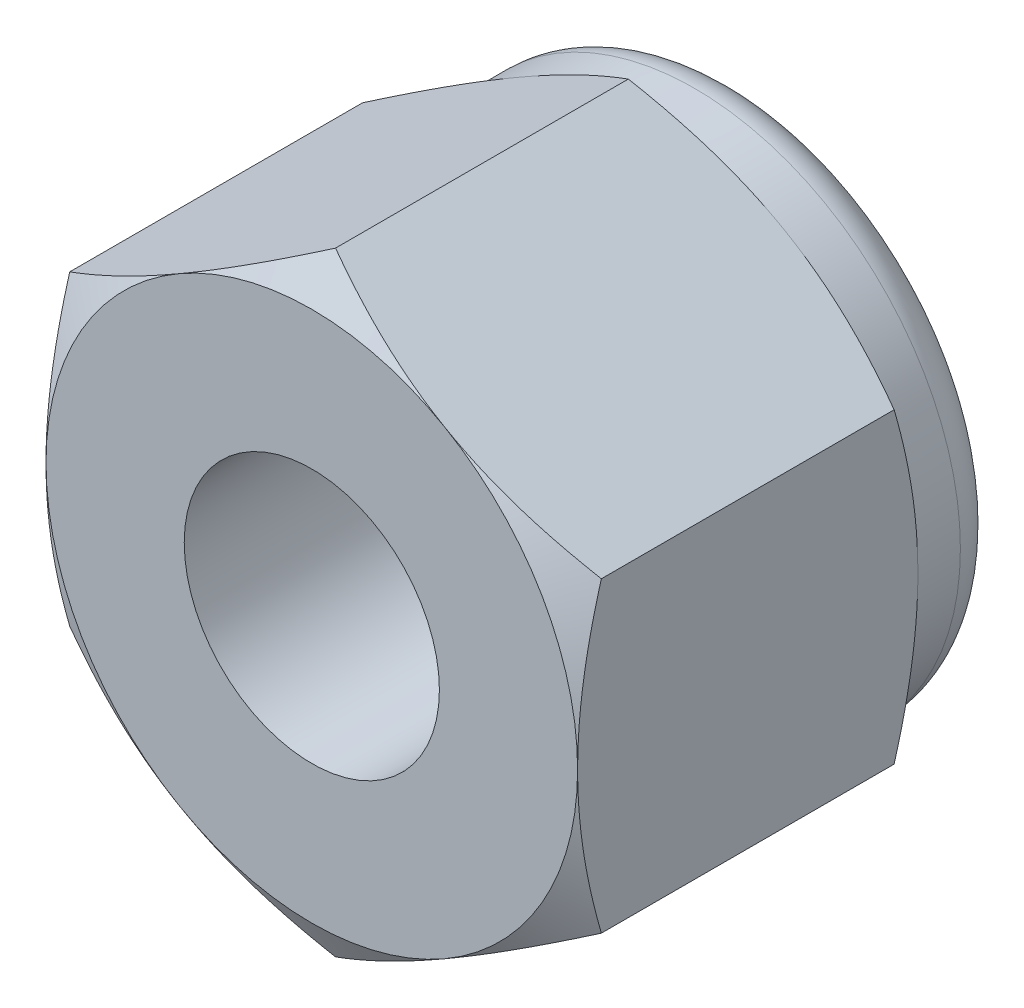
ISO-10303-21;
HEADER;
FILE_DESCRIPTION(('STEP AP214'),'2;1');
FILE_NAME('part.step','',(''),(''),'','','');
FILE_SCHEMA(('AUTOMOTIVE_DESIGN { 1 0 10303 214 1 1 1 1 }'));
ENDSEC;
DATA;
#1=APPLICATION_CONTEXT('core data for automotive mechanical design processes');
#2=APPLICATION_PROTOCOL_DEFINITION('international standard','automotive_design',2000,#1);
#3=PRODUCT_CONTEXT('',#1,'mechanical');
#4=PRODUCT('Part','Part','',(#3));
#5=PRODUCT_RELATED_PRODUCT_CATEGORY('part','',(#4));
#6=PRODUCT_DEFINITION_FORMATION('','',#4);
#7=PRODUCT_DEFINITION_CONTEXT('part definition',#1,'design');
#8=PRODUCT_DEFINITION('design','',#6,#7);
#9=PRODUCT_DEFINITION_SHAPE('','',#8);
#10=(LENGTH_UNIT() NAMED_UNIT(*) SI_UNIT(.MILLI.,.METRE.));
#11=(NAMED_UNIT(*) PLANE_ANGLE_UNIT() SI_UNIT($,.RADIAN.));
#12=(NAMED_UNIT(*) SI_UNIT($,.STERADIAN.) SOLID_ANGLE_UNIT());
#13=UNCERTAINTY_MEASURE_WITH_UNIT(LENGTH_MEASURE(1.E-05),#10,'distance_accuracy_value','');
#14=(GEOMETRIC_REPRESENTATION_CONTEXT(3) GLOBAL_UNCERTAINTY_ASSIGNED_CONTEXT((#13)) GLOBAL_UNIT_ASSIGNED_CONTEXT((#10,
#11,#12)) REPRESENTATION_CONTEXT('',''));
#15=CARTESIAN_POINT('',(0.,0.,0.));
#16=DIRECTION('',(0.,0.,1.));
#17=DIRECTION('',(1.,0.,0.));
#18=AXIS2_PLACEMENT_3D('',#15,#16,#17);
#19=CARTESIAN_POINT('',(-5.,8.66025403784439,0.));
#20=DIRECTION('',(0.,0.,-1.));
#21=DIRECTION('',(-1.,0.,0.));
#22=AXIS2_PLACEMENT_3D('',#19,#20,#21);
#23=PLANE('',#22);
#24=CARTESIAN_POINT('',(0.,0.,0.));
#25=DIRECTION('',(0.,0.,-1.));
#26=DIRECTION('',(-1.,0.,0.));
#27=AXIS2_PLACEMENT_3D('',#24,#25,#26);
#28=CIRCLE('',#27,5.);
#29=CARTESIAN_POINT('',(-5.,0.,0.));
#30=VERTEX_POINT('',#29);
#31=CARTESIAN_POINT('',(-2.5,4.3301270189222,0.));
#32=VERTEX_POINT('',#31);
#33=EDGE_CURVE('E159',#30,#32,#28,.T.);
#34=ORIENTED_EDGE('',*,*,#33,.F.);
#35=CARTESIAN_POINT('',(0.,0.,0.));
#36=DIRECTION('',(0.,0.,-1.));
#37=DIRECTION('',(-1.,0.,0.));
#38=AXIS2_PLACEMENT_3D('',#35,#36,#37);
#39=CIRCLE('',#38,5.);
#40=CARTESIAN_POINT('',(-2.5,-4.3301270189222,0.));
#41=VERTEX_POINT('',#40);
#42=EDGE_CURVE('E148',#30,#41,#39,.F.);
#43=ORIENTED_EDGE('',*,*,#42,.T.);
#44=CARTESIAN_POINT('',(2.5,-4.3301270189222,0.));
#45=VERTEX_POINT('',#44);
#46=EDGE_CURVE('E264',#41,#45,#39,.F.);
#47=ORIENTED_EDGE('',*,*,#46,.T.);
#48=CARTESIAN_POINT('',(5.,0.,0.));
#49=VERTEX_POINT('',#48);
#50=EDGE_CURVE('E269',#45,#49,#39,.F.);
#51=ORIENTED_EDGE('',*,*,#50,.T.);
#52=CARTESIAN_POINT('',(2.5,4.3301270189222,0.));
#53=VERTEX_POINT('',#52);
#54=EDGE_CURVE('E270',#49,#53,#39,.F.);
#55=ORIENTED_EDGE('',*,*,#54,.T.);
#56=EDGE_CURVE('E251',#53,#32,#39,.F.);
#57=ORIENTED_EDGE('',*,*,#56,.T.);
#58=EDGE_LOOP('',(#34,#43,#47,#51,#55,#57));
#59=FACE_BOUND('',#58,.T.);
#60=CARTESIAN_POINT('',(0.,0.,0.));
#61=DIRECTION('',(0.,0.,1.));
#62=DIRECTION('',(1.,0.,0.));
#63=AXIS2_PLACEMENT_3D('',#60,#61,#62);
#64=CIRCLE('',#63,2.4);
#65=CARTESIAN_POINT('',(2.4,0.,0.));
#66=VERTEX_POINT('',#65);
#67=EDGE_CURVE('E548',#66,#66,#64,.T.);
#68=ORIENTED_EDGE('',*,*,#67,.F.);
#69=EDGE_LOOP('',(#68));
#70=FACE_BOUND('',#69,.T.);
#71=ADVANCED_FACE('F35',(#59,#70),#23,.F.);
#72=CARTESIAN_POINT('',(0.,0.,0.));
#73=DIRECTION('',(0.,0.,-1.));
#74=DIRECTION('',(-1.,0.,0.));
#75=AXIS2_PLACEMENT_3D('',#72,#73,#74);
#76=CONICAL_SURFACE('',#75,5.,1.0471975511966);
#77=CARTESIAN_POINT('',(-5.,-7.81723155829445,-2.47077013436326));
#78=CARTESIAN_POINT('',(-5.,-7.59828218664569,-2.36430801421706));
#79=CARTESIAN_POINT('',(-5.,-7.37883686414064,-2.2588487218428));
#80=CARTESIAN_POINT('',(-5.,-6.93869075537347,-2.05049866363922));
#81=CARTESIAN_POINT('',(-5.,-6.71798978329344,-1.94760829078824));
#82=CARTESIAN_POINT('',(-5.,-6.27396202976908,-1.74445489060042));
#83=CARTESIAN_POINT('',(-5.,-6.05062753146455,-1.64420867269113));
#84=CARTESIAN_POINT('',(-5.,-5.60220380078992,-1.44773613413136));
#85=CARTESIAN_POINT('',(-5.,-5.37711465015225,-1.35150962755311));
#86=CARTESIAN_POINT('',(-5.,-4.91738090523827,-1.16105250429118));
#87=CARTESIAN_POINT('',(-5.,-4.68266557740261,-1.06699171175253));
#88=CARTESIAN_POINT('',(-5.,-4.21051243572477,-0.885837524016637));
#89=CARTESIAN_POINT('',(-5.,-3.97307432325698,-0.798744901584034));
#90=CARTESIAN_POINT('',(-5.,-3.49552198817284,-0.633766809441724));
#91=CARTESIAN_POINT('',(-5.,-3.25541407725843,-0.555863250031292));
#92=CARTESIAN_POINT('',(-5.,-2.77175465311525,-0.411721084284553));
#93=CARTESIAN_POINT('',(-5.,-2.52820422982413,-0.345478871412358));
#94=CARTESIAN_POINT('',(-5.,-2.0388544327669,-0.228144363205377));
#95=CARTESIAN_POINT('',(-5.,-1.7930752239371,-0.176969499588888));
#96=CARTESIAN_POINT('',(-5.,-1.29839566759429,-0.0926283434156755));
#97=CARTESIAN_POINT('',(-5.,-1.04949564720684,-0.0594601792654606));
#98=CARTESIAN_POINT('',(-5.,-0.553095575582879,-0.01420982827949));
#99=CARTESIAN_POINT('',(-5.,-0.305621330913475,-0.00185152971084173));
#100=CARTESIAN_POINT('',(-5.,0.189494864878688,0.00146225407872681));
#101=CARTESIAN_POINT('',(-5.,0.437136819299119,-0.00758269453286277));
#102=CARTESIAN_POINT('',(-5.,0.855652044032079,-0.0403090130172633));
#103=CARTESIAN_POINT('',(-5.,1.02696545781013,-0.0587018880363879));
#104=CARTESIAN_POINT('',(-5.,1.36837224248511,-0.104619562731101));
#105=CARTESIAN_POINT('',(-5.,1.53846545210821,-0.132145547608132));
#106=CARTESIAN_POINT('',(-5.,2.04666453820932,-0.226979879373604));
#107=CARTESIAN_POINT('',(-5.,2.38251350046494,-0.306528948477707));
#108=CARTESIAN_POINT('',(-5.,2.88489620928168,-0.444928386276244));
#109=CARTESIAN_POINT('',(-5.,3.05402007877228,-0.494915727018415));
#110=CARTESIAN_POINT('',(-5.,3.39062537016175,-0.600192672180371));
#111=CARTESIAN_POINT('',(-5.,3.55810677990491,-0.655482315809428));
#112=CARTESIAN_POINT('',(-5.,3.89147981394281,-0.770467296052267));
#113=CARTESIAN_POINT('',(-5.,4.05737190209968,-0.83016130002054));
#114=CARTESIAN_POINT('',(-5.,4.38777251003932,-0.953241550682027));
#115=CARTESIAN_POINT('',(-5.,4.55228105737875,-1.01662772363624));
#116=CARTESIAN_POINT('',(-5.,4.98255550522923,-1.18707624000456));
#117=CARTESIAN_POINT('',(-5.,5.24731881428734,-1.2966666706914));
#118=CARTESIAN_POINT('',(-5.,5.7742359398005,-1.52197179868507));
#119=CARTESIAN_POINT('',(-5.,6.03638950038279,-1.63768708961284));
#120=CARTESIAN_POINT('',(-5.,6.55866181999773,-1.87383970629));
#121=CARTESIAN_POINT('',(-5.,6.81877985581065,-1.99427862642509));
#122=CARTESIAN_POINT('',(-5.,7.33728725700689,-2.23878712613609));
#123=CARTESIAN_POINT('',(-5.,7.59567668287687,-2.36285657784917));
#124=CARTESIAN_POINT('',(-5.,8.11143726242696,-2.61404271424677));
#125=CARTESIAN_POINT('',(-5.,8.36880636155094,-2.74116360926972));
#126=CARTESIAN_POINT('',(-5.,8.88239741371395,-2.99770431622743));
#127=CARTESIAN_POINT('',(-5.,9.13861935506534,-3.12712415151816));
#128=CARTESIAN_POINT('',(-5.,9.90577282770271,-3.5180968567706));
#129=CARTESIAN_POINT('',(-5.,10.4152951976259,-3.78241365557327));
#130=CARTESIAN_POINT('',(-5.,11.3805473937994,-4.28915771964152));
#131=CARTESIAN_POINT('',(-5.,11.836528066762,-4.53110943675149));
#132=CARTESIAN_POINT('',(-5.,12.7469286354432,-5.01798929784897));
#133=CARTESIAN_POINT('',(-5.,13.2013484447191,-5.26291760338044));
#134=CARTESIAN_POINT('',(-5.,14.1075674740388,-5.75422083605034));
#135=CARTESIAN_POINT('',(-5.,14.5593704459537,-6.00058885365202));
#136=CARTESIAN_POINT('',(-5.,15.4619992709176,-6.49503212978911));
#137=CARTESIAN_POINT('',(-5.,15.9128251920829,-6.7431072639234));
#138=CARTESIAN_POINT('',(-5.,16.3633042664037,-6.99180668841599));
#139=B_SPLINE_CURVE_WITH_KNOTS('',3,(#77,#78,#79,#80,#81,#82,#83,#84,#85,#86,#87,#88,#89,#90,
#91,#92,#93,#94,#95,#96,#97,#98,#99,#100,#101,#102,#103,#104,#105,#106,#107,#108,#109,#110,#111,
#112,#113,#114,#115,#116,#117,#118,#119,#120,#121,#122,#123,#124,#125,#126,#127,#128,#129,#130,
#131,#132,#133,#134,#135,#136,#137,#138),.UNSPECIFIED.,.F.,.F.,(4,2,2,2,2,2,2,2,2,2,2,2,2,2,2,2,
2,2,2,2,2,2,2,2,2,2,2,2,2,2,4),(0.,0.730390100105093,1.46089125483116,2.19526294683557,
2.92960063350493,3.68809828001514,4.44667992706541,5.20374237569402,5.96057027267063,
6.71317011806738,7.46569172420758,8.20814759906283,8.95061852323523,9.46726307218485,
9.98397469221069,11.0179267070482,11.5469496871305,12.0759765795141,12.6048440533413,
13.1337009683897,13.993231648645,14.8528457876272,15.712752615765,16.5726291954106,
17.4337694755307,18.2949185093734,20.016871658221,21.5654503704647,23.1141135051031,
24.6579386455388,26.2016524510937),.UNSPECIFIED.);
#140=CARTESIAN_POINT('',(-5.,2.88675134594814,-0.446581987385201));
#141=VERTEX_POINT('',#140);
#142=EDGE_CURVE('E176',#141,#30,#139,.F.);
#143=ORIENTED_EDGE('',*,*,#142,.T.);
#144=ORIENTED_EDGE('',*,*,#33,.T.);
#145=CARTESIAN_POINT('',(0.0002,5.7736181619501,-0.446648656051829));
#146=CARTESIAN_POINT('',(-0.219534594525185,5.64675433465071,-0.373386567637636));
#147=CARTESIAN_POINT('',(-0.441148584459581,5.5188054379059,-0.306751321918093));
#148=CARTESIAN_POINT('',(-0.888213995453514,5.26069210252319,-0.190438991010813));
#149=CARTESIAN_POINT('',(-1.11367335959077,5.13052307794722,-0.140803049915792));
#150=CARTESIAN_POINT('',(-1.56183230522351,4.87177839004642,-0.0635510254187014));
#151=CARTESIAN_POINT('',(-1.78446209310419,4.74324302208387,-0.0354203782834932));
#152=CARTESIAN_POINT('',(-2.11918990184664,4.54998783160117,-0.0101949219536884));
#153=CARTESIAN_POINT('',(-2.23084219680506,4.48552534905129,-0.00461345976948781));
#154=CARTESIAN_POINT('',(-2.4542499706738,4.35654081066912,0.000797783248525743));
#155=CARTESIAN_POINT('',(-2.56600544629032,4.29201875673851,0.000627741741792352));
#156=CARTESIAN_POINT('',(-2.87218423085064,4.11524635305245,-0.00775363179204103));
#157=CARTESIAN_POINT('',(-3.06650608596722,4.00305457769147,-0.0218297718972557));
#158=CARTESIAN_POINT('',(-3.45386010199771,3.77941563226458,-0.0664652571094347));
#159=CARTESIAN_POINT('',(-3.64689090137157,3.66796924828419,-0.0970398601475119));
#160=CARTESIAN_POINT('',(-4.03502534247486,3.44387972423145,-0.173468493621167));
#161=CARTESIAN_POINT('',(-4.23007999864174,3.33126486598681,-0.219646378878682));
#162=CARTESIAN_POINT('',(-4.61728034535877,3.10771464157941,-0.324451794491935));
#163=CARTESIAN_POINT('',(-4.80943099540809,2.99677641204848,-0.383054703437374));
#164=CARTESIAN_POINT('',(-5.0002,2.8866358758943,-0.446648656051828));
#165=B_SPLINE_CURVE_WITH_KNOTS('',3,(#145,#146,#147,#148,#149,#150,#151,#152,#153,#154,#155,
#156,#157,#158,#159,#160,#161,#162,#163,#164),.UNSPECIFIED.,.F.,.F.,(4,2,2,2,2,2,2,2,2,4),(0.,
0.792555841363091,1.58701660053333,2.36181537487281,2.74884076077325,3.13585419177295,
3.80962362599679,4.48401723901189,5.17336882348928,5.86136694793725),.UNSPECIFIED.);
#166=EDGE_CURVE('E163',#32,#141,#165,.T.);
#167=ORIENTED_EDGE('',*,*,#166,.T.);
#168=EDGE_LOOP('',(#143,#144,#167));
#169=FACE_BOUND('',#168,.T.);
#170=ADVANCED_FACE('F183',(#169),#76,.T.);
#171=CARTESIAN_POINT('',(5.0002,2.8866358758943,-0.446648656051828));
#172=CARTESIAN_POINT('',(4.78046540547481,3.01349970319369,-0.373386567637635));
#173=CARTESIAN_POINT('',(4.55885141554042,3.1414485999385,-0.306751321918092));
#174=CARTESIAN_POINT('',(4.11178600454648,3.39956193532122,-0.190438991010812));
#175=CARTESIAN_POINT('',(3.88632664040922,3.52973095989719,-0.140803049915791));
#176=CARTESIAN_POINT('',(3.43816769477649,3.78847564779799,-0.063551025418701));
#177=CARTESIAN_POINT('',(3.2155379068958,3.91701101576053,-0.035420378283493));
#178=CARTESIAN_POINT('',(2.88081009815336,4.11026620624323,-0.0101949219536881));
#179=CARTESIAN_POINT('',(2.76915780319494,4.17472868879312,-0.00461345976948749));
#180=CARTESIAN_POINT('',(2.5457500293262,4.30371322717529,0.000797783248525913));
#181=CARTESIAN_POINT('',(2.43399455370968,4.3682352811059,0.00062774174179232));
#182=CARTESIAN_POINT('',(2.12781576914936,4.54500768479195,-0.00775363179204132));
#183=CARTESIAN_POINT('',(1.93349391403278,4.65719946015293,-0.0218297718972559));
#184=CARTESIAN_POINT('',(1.54613989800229,4.88083840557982,-0.0664652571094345));
#185=CARTESIAN_POINT('',(1.35310909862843,4.99228478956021,-0.0970398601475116));
#186=CARTESIAN_POINT('',(0.964974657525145,5.21637431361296,-0.173468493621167));
#187=CARTESIAN_POINT('',(0.769920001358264,5.32898917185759,-0.219646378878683));
#188=CARTESIAN_POINT('',(0.382719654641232,5.55253939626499,-0.324451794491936));
#189=CARTESIAN_POINT('',(0.190569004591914,5.66347762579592,-0.383054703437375));
#190=CARTESIAN_POINT('',(-0.000199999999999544,5.7736181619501,-0.446648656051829));
#191=B_SPLINE_CURVE_WITH_KNOTS('',3,(#171,#172,#173,#174,#175,#176,#177,#178,#179,#180,#181,
#182,#183,#184,#185,#186,#187,#188,#189,#190),.UNSPECIFIED.,.F.,.F.,(4,2,2,2,2,2,2,2,2,4),(0.,
0.792555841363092,1.58701660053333,2.36181537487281,2.74884076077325,3.13585419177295,
3.80962362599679,4.48401723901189,5.17336882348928,5.86136694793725),.UNSPECIFIED.);
#192=CARTESIAN_POINT('',(0.,5.77350269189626,-0.446581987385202));
#193=VERTEX_POINT('',#192);
#194=EDGE_CURVE('E201',#53,#193,#191,.T.);
#195=ORIENTED_EDGE('',*,*,#194,.T.);
#196=EDGE_CURVE('E175',#193,#32,#165,.T.);
#197=ORIENTED_EDGE('',*,*,#196,.T.);
#198=ORIENTED_EDGE('',*,*,#56,.F.);
#199=EDGE_LOOP('',(#195,#197,#198));
#200=FACE_BOUND('',#199,.T.);
#201=ADVANCED_FACE('F188',(#200),#76,.T.);
#202=CARTESIAN_POINT('',(5.,-7.81723155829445,-2.47077013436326));
#203=CARTESIAN_POINT('',(5.,-7.59828218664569,-2.36430801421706));
#204=CARTESIAN_POINT('',(5.,-7.37883686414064,-2.2588487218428));
#205=CARTESIAN_POINT('',(5.,-6.93869075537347,-2.05049866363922));
#206=CARTESIAN_POINT('',(5.,-6.71798978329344,-1.94760829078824));
#207=CARTESIAN_POINT('',(5.,-6.27396202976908,-1.74445489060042));
#208=CARTESIAN_POINT('',(5.,-6.05062753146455,-1.64420867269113));
#209=CARTESIAN_POINT('',(5.,-5.60220380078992,-1.44773613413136));
#210=CARTESIAN_POINT('',(5.,-5.37711465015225,-1.35150962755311));
#211=CARTESIAN_POINT('',(5.,-4.91738090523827,-1.16105250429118));
#212=CARTESIAN_POINT('',(5.,-4.68266557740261,-1.06699171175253));
#213=CARTESIAN_POINT('',(5.,-4.21051243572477,-0.885837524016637));
#214=CARTESIAN_POINT('',(5.,-3.97307432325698,-0.798744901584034));
#215=CARTESIAN_POINT('',(5.,-3.49552198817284,-0.633766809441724));
#216=CARTESIAN_POINT('',(5.,-3.25541407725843,-0.555863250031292));
#217=CARTESIAN_POINT('',(5.,-2.77175465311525,-0.411721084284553));
#218=CARTESIAN_POINT('',(5.,-2.52820422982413,-0.345478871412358));
#219=CARTESIAN_POINT('',(5.,-2.0388544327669,-0.228144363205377));
#220=CARTESIAN_POINT('',(5.,-1.7930752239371,-0.176969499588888));
#221=CARTESIAN_POINT('',(5.,-1.29839566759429,-0.0926283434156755));
#222=CARTESIAN_POINT('',(5.,-1.04949564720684,-0.0594601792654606));
#223=CARTESIAN_POINT('',(5.,-0.553095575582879,-0.01420982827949));
#224=CARTESIAN_POINT('',(5.,-0.305621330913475,-0.00185152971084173));
#225=CARTESIAN_POINT('',(5.,0.189494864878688,0.00146225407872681));
#226=CARTESIAN_POINT('',(5.,0.437136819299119,-0.00758269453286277));
#227=CARTESIAN_POINT('',(5.,0.855652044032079,-0.0403090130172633));
#228=CARTESIAN_POINT('',(5.,1.02696545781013,-0.0587018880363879));
#229=CARTESIAN_POINT('',(5.,1.36837224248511,-0.104619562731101));
#230=CARTESIAN_POINT('',(5.,1.53846545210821,-0.132145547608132));
#231=CARTESIAN_POINT('',(5.,2.04666453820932,-0.226979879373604));
#232=CARTESIAN_POINT('',(5.,2.38251350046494,-0.306528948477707));
#233=CARTESIAN_POINT('',(5.,2.88489620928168,-0.444928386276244));
#234=CARTESIAN_POINT('',(5.,3.05402007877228,-0.494915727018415));
#235=CARTESIAN_POINT('',(5.,3.39062537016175,-0.600192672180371));
#236=CARTESIAN_POINT('',(5.,3.55810677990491,-0.655482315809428));
#237=CARTESIAN_POINT('',(5.,3.89147981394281,-0.770467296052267));
#238=CARTESIAN_POINT('',(5.,4.05737190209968,-0.83016130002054));
#239=CARTESIAN_POINT('',(5.,4.38777251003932,-0.953241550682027));
#240=CARTESIAN_POINT('',(5.,4.55228105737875,-1.01662772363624));
#241=CARTESIAN_POINT('',(5.,4.98255550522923,-1.18707624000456));
#242=CARTESIAN_POINT('',(5.,5.24731881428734,-1.2966666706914));
#243=CARTESIAN_POINT('',(5.,5.7742359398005,-1.52197179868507));
#244=CARTESIAN_POINT('',(5.,6.03638950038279,-1.63768708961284));
#245=CARTESIAN_POINT('',(5.,6.55866181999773,-1.87383970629));
#246=CARTESIAN_POINT('',(5.,6.81877985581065,-1.99427862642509));
#247=CARTESIAN_POINT('',(5.,7.33728725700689,-2.23878712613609));
#248=CARTESIAN_POINT('',(5.,7.59567668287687,-2.36285657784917));
#249=CARTESIAN_POINT('',(5.,8.11143726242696,-2.61404271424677));
#250=CARTESIAN_POINT('',(5.,8.36880636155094,-2.74116360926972));
#251=CARTESIAN_POINT('',(5.,8.88239741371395,-2.99770431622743));
#252=CARTESIAN_POINT('',(5.,9.13861935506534,-3.12712415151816));
#253=CARTESIAN_POINT('',(5.,9.90577282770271,-3.5180968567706));
#254=CARTESIAN_POINT('',(5.,10.4152951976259,-3.78241365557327));
#255=CARTESIAN_POINT('',(5.,11.3805473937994,-4.28915771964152));
#256=CARTESIAN_POINT('',(5.,11.836528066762,-4.53110943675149));
#257=CARTESIAN_POINT('',(5.,12.7469286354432,-5.01798929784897));
#258=CARTESIAN_POINT('',(5.,13.2013484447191,-5.26291760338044));
#259=CARTESIAN_POINT('',(5.,14.1075674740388,-5.75422083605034));
#260=CARTESIAN_POINT('',(5.,14.5593704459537,-6.00058885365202));
#261=CARTESIAN_POINT('',(5.,15.4619992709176,-6.49503212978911));
#262=CARTESIAN_POINT('',(5.,15.9128251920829,-6.7431072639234));
#263=CARTESIAN_POINT('',(5.,16.3633042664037,-6.99180668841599));
#264=B_SPLINE_CURVE_WITH_KNOTS('',3,(#202,#203,#204,#205,#206,#207,#208,#209,#210,#211,#212,
#213,#214,#215,#216,#217,#218,#219,#220,#221,#222,#223,#224,#225,#226,#227,#228,#229,#230,#231,
#232,#233,#234,#235,#236,#237,#238,#239,#240,#241,#242,#243,#244,#245,#246,#247,#248,#249,#250,
#251,#252,#253,#254,#255,#256,#257,#258,#259,#260,#261,#262,#263),.UNSPECIFIED.,.F.,.F.,(4,2,2,
2,2,2,2,2,2,2,2,2,2,2,2,2,2,2,2,2,2,2,2,2,2,2,2,2,2,2,4),(0.,0.730390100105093,1.46089125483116,
2.19526294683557,2.92960063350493,3.68809828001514,4.44667992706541,5.20374237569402,
5.96057027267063,6.71317011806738,7.46569172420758,8.20814759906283,8.95061852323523,
9.46726307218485,9.98397469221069,11.0179267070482,11.5469496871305,12.0759765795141,
12.6048440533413,13.1337009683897,13.993231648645,14.8528457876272,15.712752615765,
16.5726291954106,17.4337694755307,18.2949185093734,20.016871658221,21.5654503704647,
23.1141135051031,24.6579386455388,26.2016524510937),.UNSPECIFIED.);
#265=CARTESIAN_POINT('',(5.,2.88675134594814,-0.446581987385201));
#266=VERTEX_POINT('',#265);
#267=EDGE_CURVE('E212',#49,#266,#264,.T.);
#268=ORIENTED_EDGE('',*,*,#267,.T.);
#269=EDGE_CURVE('E289',#266,#53,#191,.T.);
#270=ORIENTED_EDGE('',*,*,#269,.T.);
#271=ORIENTED_EDGE('',*,*,#54,.F.);
#272=EDGE_LOOP('',(#268,#270,#271));
#273=FACE_BOUND('',#272,.T.);
#274=ADVANCED_FACE('F288',(#273),#76,.T.);
#275=CARTESIAN_POINT('',(-0.0002,-5.7736181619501,-0.446648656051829));
#276=CARTESIAN_POINT('',(0.219534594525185,-5.64675433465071,-0.373386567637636));
#277=CARTESIAN_POINT('',(0.441148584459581,-5.5188054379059,-0.306751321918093));
#278=CARTESIAN_POINT('',(0.888213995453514,-5.26069210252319,-0.190438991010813));
#279=CARTESIAN_POINT('',(1.11367335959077,-5.13052307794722,-0.140803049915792));
#280=CARTESIAN_POINT('',(1.56183230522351,-4.87177839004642,-0.0635510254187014));
#281=CARTESIAN_POINT('',(1.78446209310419,-4.74324302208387,-0.0354203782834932));
#282=CARTESIAN_POINT('',(2.11918990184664,-4.54998783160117,-0.0101949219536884));
#283=CARTESIAN_POINT('',(2.23084219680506,-4.48552534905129,-0.00461345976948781));
#284=CARTESIAN_POINT('',(2.4542499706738,-4.35654081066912,0.000797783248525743));
#285=CARTESIAN_POINT('',(2.56600544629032,-4.29201875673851,0.000627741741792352));
#286=CARTESIAN_POINT('',(2.87218423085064,-4.11524635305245,-0.00775363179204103));
#287=CARTESIAN_POINT('',(3.06650608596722,-4.00305457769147,-0.0218297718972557));
#288=CARTESIAN_POINT('',(3.45386010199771,-3.77941563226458,-0.0664652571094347));
#289=CARTESIAN_POINT('',(3.64689090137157,-3.66796924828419,-0.0970398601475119));
#290=CARTESIAN_POINT('',(4.03502534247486,-3.44387972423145,-0.173468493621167));
#291=CARTESIAN_POINT('',(4.23007999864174,-3.33126486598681,-0.219646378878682));
#292=CARTESIAN_POINT('',(4.61728034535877,-3.10771464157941,-0.324451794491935));
#293=CARTESIAN_POINT('',(4.80943099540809,-2.99677641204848,-0.383054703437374));
#294=CARTESIAN_POINT('',(5.0002,-2.8866358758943,-0.446648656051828));
#295=B_SPLINE_CURVE_WITH_KNOTS('',3,(#275,#276,#277,#278,#279,#280,#281,#282,#283,#284,#285,
#286,#287,#288,#289,#290,#291,#292,#293,#294),.UNSPECIFIED.,.F.,.F.,(4,2,2,2,2,2,2,2,2,4),(0.,
0.792555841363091,1.58701660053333,2.36181537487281,2.74884076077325,3.13585419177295,
3.80962362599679,4.48401723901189,5.17336882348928,5.86136694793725),.UNSPECIFIED.);
#296=CARTESIAN_POINT('',(5.,-2.88675134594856,-0.446581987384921));
#297=VERTEX_POINT('',#296);
#298=EDGE_CURVE('E218',#45,#297,#295,.T.);
#299=ORIENTED_EDGE('',*,*,#298,.T.);
#300=EDGE_CURVE('E217',#297,#49,#264,.T.);
#301=ORIENTED_EDGE('',*,*,#300,.T.);
#302=ORIENTED_EDGE('',*,*,#50,.F.);
#303=EDGE_LOOP('',(#299,#301,#302));
#304=FACE_BOUND('',#303,.T.);
#305=ADVANCED_FACE('F312',(#304),#76,.T.);
#306=CARTESIAN_POINT('',(0.,-5.77350269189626,-0.446581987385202));
#307=VERTEX_POINT('',#306);
#308=EDGE_CURVE('E138',#307,#45,#295,.T.);
#309=ORIENTED_EDGE('',*,*,#308,.T.);
#310=ORIENTED_EDGE('',*,*,#46,.F.);
#311=CARTESIAN_POINT('',(-5.0002,-2.8866358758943,-0.446648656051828));
#312=CARTESIAN_POINT('',(-4.78046540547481,-3.01349970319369,-0.373386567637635));
#313=CARTESIAN_POINT('',(-4.55885141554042,-3.1414485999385,-0.306751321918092));
#314=CARTESIAN_POINT('',(-4.11178600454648,-3.39956193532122,-0.190438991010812));
#315=CARTESIAN_POINT('',(-3.88632664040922,-3.52973095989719,-0.140803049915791));
#316=CARTESIAN_POINT('',(-3.43816769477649,-3.78847564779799,-0.063551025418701));
#317=CARTESIAN_POINT('',(-3.2155379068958,-3.91701101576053,-0.035420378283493));
#318=CARTESIAN_POINT('',(-2.88081009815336,-4.11026620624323,-0.0101949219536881));
#319=CARTESIAN_POINT('',(-2.76915780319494,-4.17472868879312,-0.00461345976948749));
#320=CARTESIAN_POINT('',(-2.5457500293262,-4.30371322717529,0.000797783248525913));
#321=CARTESIAN_POINT('',(-2.43399455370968,-4.3682352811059,0.00062774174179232));
#322=CARTESIAN_POINT('',(-2.12781576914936,-4.54500768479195,-0.00775363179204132));
#323=CARTESIAN_POINT('',(-1.93349391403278,-4.65719946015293,-0.0218297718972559));
#324=CARTESIAN_POINT('',(-1.54613989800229,-4.88083840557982,-0.0664652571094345));
#325=CARTESIAN_POINT('',(-1.35310909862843,-4.99228478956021,-0.0970398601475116));
#326=CARTESIAN_POINT('',(-0.964974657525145,-5.21637431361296,-0.173468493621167));
#327=CARTESIAN_POINT('',(-0.769920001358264,-5.32898917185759,-0.219646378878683));
#328=CARTESIAN_POINT('',(-0.382719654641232,-5.55253939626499,-0.324451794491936));
#329=CARTESIAN_POINT('',(-0.190569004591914,-5.66347762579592,-0.383054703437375));
#330=CARTESIAN_POINT('',(0.000199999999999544,-5.7736181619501,-0.446648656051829));
#331=B_SPLINE_CURVE_WITH_KNOTS('',3,(#311,#312,#313,#314,#315,#316,#317,#318,#319,#320,#321,
#322,#323,#324,#325,#326,#327,#328,#329,#330),.UNSPECIFIED.,.F.,.F.,(4,2,2,2,2,2,2,2,2,4),(0.,
0.792555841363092,1.58701660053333,2.36181537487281,2.74884076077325,3.13585419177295,
3.80962362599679,4.48401723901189,5.17336882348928,5.86136694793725),.UNSPECIFIED.);
#332=EDGE_CURVE('E309',#41,#307,#331,.T.);
#333=ORIENTED_EDGE('',*,*,#332,.T.);
#334=EDGE_LOOP('',(#309,#310,#333));
#335=FACE_BOUND('',#334,.T.);
#336=ADVANCED_FACE('F190',(#335),#76,.T.);
#337=CARTESIAN_POINT('',(-5.,-2.88675134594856,-0.446581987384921));
#338=VERTEX_POINT('',#337);
#339=EDGE_CURVE('E206',#338,#41,#331,.T.);
#340=ORIENTED_EDGE('',*,*,#339,.T.);
#341=ORIENTED_EDGE('',*,*,#42,.F.);
#342=EDGE_CURVE('E292',#30,#338,#139,.F.);
#343=ORIENTED_EDGE('',*,*,#342,.T.);
#344=EDGE_LOOP('',(#340,#341,#343));
#345=FACE_BOUND('',#344,.T.);
#346=ADVANCED_FACE('F305',(#345),#76,.T.);
#347=CARTESIAN_POINT('',(5.,2.88675134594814,-6.4));
#348=DIRECTION('',(0.5,0.866025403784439,0.));
#349=DIRECTION('',(-0.866025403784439,0.5,0.));
#350=AXIS2_PLACEMENT_3D('',#347,#348,#349);
#351=PLANE('',#350);
#352=CARTESIAN_POINT('',(-0.0002,5.7736181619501,-5.95335134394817));
#353=CARTESIAN_POINT('',(0.219534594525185,5.64675433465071,-6.02661343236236));
#354=CARTESIAN_POINT('',(0.441148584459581,5.5188054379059,-6.09324867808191));
#355=CARTESIAN_POINT('',(0.888213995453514,5.26069210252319,-6.20956100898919));
#356=CARTESIAN_POINT('',(1.11367335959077,5.13052307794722,-6.25919695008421));
#357=CARTESIAN_POINT('',(1.56183230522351,4.87177839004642,-6.3364489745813));
#358=CARTESIAN_POINT('',(1.78446209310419,4.74324302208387,-6.3645796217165));
#359=CARTESIAN_POINT('',(2.11918990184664,4.54998783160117,-6.38980507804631));
#360=CARTESIAN_POINT('',(2.23084219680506,4.48552534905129,-6.39538654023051));
#361=CARTESIAN_POINT('',(2.4542499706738,4.35654081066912,-6.40079778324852));
#362=CARTESIAN_POINT('',(2.56600544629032,4.29201875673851,-6.40062774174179));
#363=CARTESIAN_POINT('',(2.87218423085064,4.11524635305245,-6.39224636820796));
#364=CARTESIAN_POINT('',(3.06650608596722,4.00305457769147,-6.37817022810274));
#365=CARTESIAN_POINT('',(3.45386010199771,3.77941563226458,-6.33353474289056));
#366=CARTESIAN_POINT('',(3.64689090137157,3.66796924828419,-6.30296013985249));
#367=CARTESIAN_POINT('',(4.03502534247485,3.44387972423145,-6.22653150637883));
#368=CARTESIAN_POINT('',(4.23007999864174,3.33126486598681,-6.18035362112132));
#369=CARTESIAN_POINT('',(4.61728034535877,3.10771464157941,-6.07554820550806));
#370=CARTESIAN_POINT('',(4.80943099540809,2.99677641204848,-6.01694529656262));
#371=CARTESIAN_POINT('',(5.0002,2.8866358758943,-5.95335134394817));
#372=B_SPLINE_CURVE_WITH_KNOTS('',3,(#352,#353,#354,#355,#356,#357,#358,#359,#360,#361,#362,
#363,#364,#365,#366,#367,#368,#369,#370,#371),.UNSPECIFIED.,.F.,.F.,(4,2,2,2,2,2,2,2,2,4),(0.,
0.792555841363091,1.58701660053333,2.36181537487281,2.74884076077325,3.13585419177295,
3.80962362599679,4.48401723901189,5.17336882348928,5.86136694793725),.UNSPECIFIED.);
#373=CARTESIAN_POINT('',(0.,5.77350269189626,-5.9534180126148));
#374=VERTEX_POINT('',#373);
#375=CARTESIAN_POINT('',(2.5,4.3301270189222,-6.4));
#376=VERTEX_POINT('',#375);
#377=EDGE_CURVE('E142',#374,#376,#372,.T.);
#378=ORIENTED_EDGE('',*,*,#377,.F.);
#379=DIRECTION('',(0.,0.,1.));
#380=VECTOR('',#379,1.);
#381=CARTESIAN_POINT('',(0.,5.77350269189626,-6.4));
#382=LINE('',#381,#380);
#383=EDGE_CURVE('E135',#374,#193,#382,.T.);
#384=ORIENTED_EDGE('',*,*,#383,.T.);
#385=ORIENTED_EDGE('',*,*,#194,.F.);
#386=ORIENTED_EDGE('',*,*,#269,.F.);
#387=DIRECTION('',(0.,0.,1.));
#388=VECTOR('',#387,1.);
#389=CARTESIAN_POINT('',(5.,2.88675134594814,-6.4));
#390=LINE('',#389,#388);
#391=CARTESIAN_POINT('',(5.,2.88675134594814,-5.9534180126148));
#392=VERTEX_POINT('',#391);
#393=EDGE_CURVE('E248',#392,#266,#390,.T.);
#394=ORIENTED_EDGE('',*,*,#393,.F.);
#395=EDGE_CURVE('E243',#376,#392,#372,.T.);
#396=ORIENTED_EDGE('',*,*,#395,.F.);
#397=EDGE_LOOP('',(#378,#384,#385,#386,#394,#396));
#398=FACE_BOUND('',#397,.T.);
#399=ADVANCED_FACE('F37',(#398),#351,.T.);
#400=CARTESIAN_POINT('',(5.,-2.88675134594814,-6.4));
#401=DIRECTION('',(1.,0.,0.));
#402=DIRECTION('',(0.,0.,-1.));
#403=AXIS2_PLACEMENT_3D('',#400,#401,#402);
#404=PLANE('',#403);
#405=CARTESIAN_POINT('',(5.,-7.81723155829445,-3.92922986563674));
#406=CARTESIAN_POINT('',(5.,-7.59828218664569,-4.03569198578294));
#407=CARTESIAN_POINT('',(5.,-7.37883686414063,-4.1411512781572));
#408=CARTESIAN_POINT('',(5.,-6.93869075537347,-4.34950133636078));
#409=CARTESIAN_POINT('',(5.,-6.71798978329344,-4.45239170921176));
#410=CARTESIAN_POINT('',(5.,-6.27396202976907,-4.65554510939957));
#411=CARTESIAN_POINT('',(5.,-6.05062753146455,-4.75579132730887));
#412=CARTESIAN_POINT('',(5.,-5.60220380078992,-4.95226386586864));
#413=CARTESIAN_POINT('',(5.,-5.37711465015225,-5.04849037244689));
#414=CARTESIAN_POINT('',(5.,-4.91738090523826,-5.23894749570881));
#415=CARTESIAN_POINT('',(5.,-4.68266557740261,-5.33300828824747));
#416=CARTESIAN_POINT('',(5.,-4.21051243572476,-5.51416247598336));
#417=CARTESIAN_POINT('',(5.,-3.97307432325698,-5.60125509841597));
#418=CARTESIAN_POINT('',(5.,-3.49552198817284,-5.76623319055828));
#419=CARTESIAN_POINT('',(5.,-3.25541407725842,-5.84413674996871));
#420=CARTESIAN_POINT('',(5.,-2.77175465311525,-5.98827891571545));
#421=CARTESIAN_POINT('',(5.,-2.52820422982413,-6.05452112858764));
#422=CARTESIAN_POINT('',(5.,-2.0388544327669,-6.17185563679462));
#423=CARTESIAN_POINT('',(5.,-1.79307522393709,-6.22303050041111));
#424=CARTESIAN_POINT('',(5.,-1.29839566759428,-6.30737165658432));
#425=CARTESIAN_POINT('',(5.,-1.04949564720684,-6.34053982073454));
#426=CARTESIAN_POINT('',(5.,-0.553095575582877,-6.38579017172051));
#427=CARTESIAN_POINT('',(5.,-0.305621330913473,-6.39814847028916));
#428=CARTESIAN_POINT('',(5.,0.189494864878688,-6.40146225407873));
#429=CARTESIAN_POINT('',(5.,0.437136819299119,-6.39241730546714));
#430=CARTESIAN_POINT('',(5.,0.855652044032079,-6.35969098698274));
#431=CARTESIAN_POINT('',(5.,1.02696545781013,-6.34129811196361));
#432=CARTESIAN_POINT('',(5.,1.36837224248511,-6.2953804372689));
#433=CARTESIAN_POINT('',(5.,1.53846545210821,-6.26785445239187));
#434=CARTESIAN_POINT('',(5.,2.04666453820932,-6.1730201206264));
#435=CARTESIAN_POINT('',(5.,2.38251350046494,-6.09347105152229));
#436=CARTESIAN_POINT('',(5.,2.88489620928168,-5.95507161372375));
#437=CARTESIAN_POINT('',(5.,3.05402007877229,-5.90508427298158));
#438=CARTESIAN_POINT('',(5.,3.39062537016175,-5.79980732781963));
#439=CARTESIAN_POINT('',(5.,3.55810677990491,-5.74451768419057));
#440=CARTESIAN_POINT('',(5.,3.89147981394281,-5.62953270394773));
#441=CARTESIAN_POINT('',(5.,4.05737190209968,-5.56983869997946));
#442=CARTESIAN_POINT('',(5.,4.38777251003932,-5.44675844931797));
#443=CARTESIAN_POINT('',(5.,4.55228105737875,-5.38337227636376));
#444=CARTESIAN_POINT('',(5.,4.98255550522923,-5.21292375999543));
#445=CARTESIAN_POINT('',(5.,5.24731881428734,-5.1033333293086));
#446=CARTESIAN_POINT('',(5.,5.7742359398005,-4.87802820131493));
#447=CARTESIAN_POINT('',(5.,6.03638950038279,-4.76231291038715));
#448=CARTESIAN_POINT('',(5.,6.55866181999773,-4.52616029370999));
#449=CARTESIAN_POINT('',(5.,6.81877985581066,-4.4057213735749));
#450=CARTESIAN_POINT('',(5.,7.33728725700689,-4.1612128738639));
#451=CARTESIAN_POINT('',(5.,7.59567668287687,-4.03714342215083));
#452=CARTESIAN_POINT('',(5.,8.11143726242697,-3.78595728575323));
#453=CARTESIAN_POINT('',(5.,8.36880636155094,-3.65883639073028));
#454=CARTESIAN_POINT('',(5.,8.88239741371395,-3.40229568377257));
#455=CARTESIAN_POINT('',(5.,9.13861935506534,-3.27287584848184));
#456=CARTESIAN_POINT('',(5.,9.90577282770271,-2.8819031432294));
#457=CARTESIAN_POINT('',(5.,10.4152951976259,-2.61758634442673));
#458=CARTESIAN_POINT('',(5.,11.3805473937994,-2.11084228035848));
#459=CARTESIAN_POINT('',(5.,11.836528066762,-1.86889056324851));
#460=CARTESIAN_POINT('',(5.,12.7469286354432,-1.38201070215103));
#461=CARTESIAN_POINT('',(5.,13.2013484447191,-1.13708239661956));
#462=CARTESIAN_POINT('',(5.,14.1075674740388,-0.645779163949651));
#463=CARTESIAN_POINT('',(5.,14.5593704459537,-0.399411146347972));
#464=CARTESIAN_POINT('',(5.,15.4619992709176,0.0950321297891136));
#465=CARTESIAN_POINT('',(5.,15.9128251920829,0.343107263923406));
#466=CARTESIAN_POINT('',(5.,16.3633042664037,0.591806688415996));
#467=B_SPLINE_CURVE_WITH_KNOTS('',3,(#405,#406,#407,#408,#409,#410,#411,#412,#413,#414,#415,
#416,#417,#418,#419,#420,#421,#422,#423,#424,#425,#426,#427,#428,#429,#430,#431,#432,#433,#434,
#435,#436,#437,#438,#439,#440,#441,#442,#443,#444,#445,#446,#447,#448,#449,#450,#451,#452,#453,
#454,#455,#456,#457,#458,#459,#460,#461,#462,#463,#464,#465,#466),.UNSPECIFIED.,.F.,.F.,(4,2,2,
2,2,2,2,2,2,2,2,2,2,2,2,2,2,2,2,2,2,2,2,2,2,2,2,2,2,2,4),(0.,0.730390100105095,1.46089125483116,
2.19526294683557,2.92960063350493,3.68809828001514,4.44667992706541,5.20374237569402,
5.96057027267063,6.71317011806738,7.46569172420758,8.20814759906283,8.95061852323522,
9.46726307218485,9.98397469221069,11.0179267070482,11.5469496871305,12.0759765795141,
12.6048440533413,13.1337009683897,13.993231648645,14.8528457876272,15.712752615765,
16.5726291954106,17.4337694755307,18.2949185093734,20.016871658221,21.5654503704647,
23.1141135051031,24.6579386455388,26.2016524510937),.UNSPECIFIED.);
#468=CARTESIAN_POINT('',(5.,0.,-6.4));
#469=VERTEX_POINT('',#468);
#470=EDGE_CURVE('E237',#392,#469,#467,.F.);
#471=ORIENTED_EDGE('',*,*,#470,.F.);
#472=ORIENTED_EDGE('',*,*,#393,.T.);
#473=ORIENTED_EDGE('',*,*,#267,.F.);
#474=ORIENTED_EDGE('',*,*,#300,.F.);
#475=DIRECTION('',(0.,0.,1.));
#476=VECTOR('',#475,1.);
#477=CARTESIAN_POINT('',(5.,-2.88675134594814,-6.4));
#478=LINE('',#477,#476);
#479=CARTESIAN_POINT('',(5.,-2.88675134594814,-5.9534180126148));
#480=VERTEX_POINT('',#479);
#481=EDGE_CURVE('E252',#480,#297,#478,.T.);
#482=ORIENTED_EDGE('',*,*,#481,.F.);
#483=EDGE_CURVE('E231',#469,#480,#467,.F.);
#484=ORIENTED_EDGE('',*,*,#483,.F.);
#485=EDGE_LOOP('',(#471,#472,#473,#474,#482,#484));
#486=FACE_BOUND('',#485,.T.);
#487=ADVANCED_FACE('F223',(#486),#404,.T.);
#488=CARTESIAN_POINT('',(5.,-2.88675134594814,-6.4));
#489=DIRECTION('',(0.5,-0.866025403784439,0.));
#490=DIRECTION('',(0.866025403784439,0.5,0.));
#491=AXIS2_PLACEMENT_3D('',#488,#489,#490);
#492=PLANE('',#491);
#493=CARTESIAN_POINT('',(5.0002,-2.8866358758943,-5.95335134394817));
#494=CARTESIAN_POINT('',(4.78046540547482,-3.01349970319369,-6.02661343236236));
#495=CARTESIAN_POINT('',(4.55885141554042,-3.1414485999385,-6.09324867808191));
#496=CARTESIAN_POINT('',(4.11178600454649,-3.39956193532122,-6.20956100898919));
#497=CARTESIAN_POINT('',(3.88632664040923,-3.52973095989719,-6.25919695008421));
#498=CARTESIAN_POINT('',(3.43816769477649,-3.78847564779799,-6.3364489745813));
#499=CARTESIAN_POINT('',(3.21553790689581,-3.91701101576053,-6.3645796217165));
#500=CARTESIAN_POINT('',(2.88081009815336,-4.11026620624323,-6.38980507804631));
#501=CARTESIAN_POINT('',(2.76915780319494,-4.17472868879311,-6.39538654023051));
#502=CARTESIAN_POINT('',(2.5457500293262,-4.30371322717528,-6.40079778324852));
#503=CARTESIAN_POINT('',(2.43399455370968,-4.3682352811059,-6.40062774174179));
#504=CARTESIAN_POINT('',(2.12781576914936,-4.54500768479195,-6.39224636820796));
#505=CARTESIAN_POINT('',(1.93349391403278,-4.65719946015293,-6.37817022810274));
#506=CARTESIAN_POINT('',(1.54613989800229,-4.88083840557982,-6.33353474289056));
#507=CARTESIAN_POINT('',(1.35310909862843,-4.99228478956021,-6.30296013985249));
#508=CARTESIAN_POINT('',(0.964974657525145,-5.21637431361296,-6.22653150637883));
#509=CARTESIAN_POINT('',(0.769920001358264,-5.32898917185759,-6.18035362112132));
#510=CARTESIAN_POINT('',(0.382719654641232,-5.55253939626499,-6.07554820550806));
#511=CARTESIAN_POINT('',(0.190569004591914,-5.66347762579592,-6.01694529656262));
#512=CARTESIAN_POINT('',(-0.000199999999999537,-5.7736181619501,-5.95335134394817));
#513=B_SPLINE_CURVE_WITH_KNOTS('',3,(#493,#494,#495,#496,#497,#498,#499,#500,#501,#502,#503,
#504,#505,#506,#507,#508,#509,#510,#511,#512),.UNSPECIFIED.,.F.,.F.,(4,2,2,2,2,2,2,2,2,4),(0.,
0.79255584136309,1.58701660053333,2.36181537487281,2.74884076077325,3.13585419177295,
3.80962362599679,4.48401723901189,5.17336882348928,5.86136694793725),.UNSPECIFIED.);
#514=CARTESIAN_POINT('',(2.5,-4.3301270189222,-6.4));
#515=VERTEX_POINT('',#514);
#516=EDGE_CURVE('E59',#480,#515,#513,.T.);
#517=ORIENTED_EDGE('',*,*,#516,.F.);
#518=ORIENTED_EDGE('',*,*,#481,.T.);
#519=ORIENTED_EDGE('',*,*,#298,.F.);
#520=ORIENTED_EDGE('',*,*,#308,.F.);
#521=DIRECTION('',(0.,0.,1.));
#522=VECTOR('',#521,1.);
#523=CARTESIAN_POINT('',(0.,-5.77350269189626,-6.4));
#524=LINE('',#523,#522);
#525=CARTESIAN_POINT('',(0.,-5.77350269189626,-5.9534180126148));
#526=VERTEX_POINT('',#525);
#527=EDGE_CURVE('E255',#526,#307,#524,.T.);
#528=ORIENTED_EDGE('',*,*,#527,.F.);
#529=EDGE_CURVE('E238',#515,#526,#513,.T.);
#530=ORIENTED_EDGE('',*,*,#529,.F.);
#531=EDGE_LOOP('',(#517,#518,#519,#520,#528,#530));
#532=FACE_BOUND('',#531,.T.);
#533=ADVANCED_FACE('F226',(#532),#492,.T.);
#534=CARTESIAN_POINT('',(-5.,-2.88675134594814,-6.4));
#535=DIRECTION('',(-0.5,-0.866025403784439,0.));
#536=DIRECTION('',(0.866025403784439,-0.5,0.));
#537=AXIS2_PLACEMENT_3D('',#534,#535,#536);
#538=PLANE('',#537);
#539=CARTESIAN_POINT('',(0.0002,-5.7736181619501,-5.95335134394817));
#540=CARTESIAN_POINT('',(-0.219534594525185,-5.64675433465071,-6.02661343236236));
#541=CARTESIAN_POINT('',(-0.441148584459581,-5.5188054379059,-6.09324867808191));
#542=CARTESIAN_POINT('',(-0.888213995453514,-5.26069210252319,-6.20956100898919));
#543=CARTESIAN_POINT('',(-1.11367335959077,-5.13052307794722,-6.25919695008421));
#544=CARTESIAN_POINT('',(-1.56183230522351,-4.87177839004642,-6.3364489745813));
#545=CARTESIAN_POINT('',(-1.78446209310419,-4.74324302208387,-6.3645796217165));
#546=CARTESIAN_POINT('',(-2.11918990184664,-4.54998783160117,-6.38980507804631));
#547=CARTESIAN_POINT('',(-2.23084219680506,-4.48552534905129,-6.39538654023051));
#548=CARTESIAN_POINT('',(-2.4542499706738,-4.35654081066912,-6.40079778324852));
#549=CARTESIAN_POINT('',(-2.56600544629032,-4.29201875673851,-6.40062774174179));
#550=CARTESIAN_POINT('',(-2.87218423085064,-4.11524635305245,-6.39224636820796));
#551=CARTESIAN_POINT('',(-3.06650608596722,-4.00305457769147,-6.37817022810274));
#552=CARTESIAN_POINT('',(-3.45386010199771,-3.77941563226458,-6.33353474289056));
#553=CARTESIAN_POINT('',(-3.64689090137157,-3.66796924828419,-6.30296013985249));
#554=CARTESIAN_POINT('',(-4.03502534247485,-3.44387972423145,-6.22653150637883));
#555=CARTESIAN_POINT('',(-4.23007999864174,-3.33126486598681,-6.18035362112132));
#556=CARTESIAN_POINT('',(-4.61728034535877,-3.10771464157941,-6.07554820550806));
#557=CARTESIAN_POINT('',(-4.80943099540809,-2.99677641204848,-6.01694529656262));
#558=CARTESIAN_POINT('',(-5.0002,-2.8866358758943,-5.95335134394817));
#559=B_SPLINE_CURVE_WITH_KNOTS('',3,(#539,#540,#541,#542,#543,#544,#545,#546,#547,#548,#549,
#550,#551,#552,#553,#554,#555,#556,#557,#558),.UNSPECIFIED.,.F.,.F.,(4,2,2,2,2,2,2,2,2,4),(0.,
0.792555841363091,1.58701660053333,2.36181537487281,2.74884076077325,3.13585419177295,
3.80962362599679,4.48401723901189,5.17336882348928,5.86136694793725),.UNSPECIFIED.);
#560=CARTESIAN_POINT('',(-2.5,-4.3301270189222,-6.4));
#561=VERTEX_POINT('',#560);
#562=EDGE_CURVE('E52',#526,#561,#559,.T.);
#563=ORIENTED_EDGE('',*,*,#562,.F.);
#564=ORIENTED_EDGE('',*,*,#527,.T.);
#565=ORIENTED_EDGE('',*,*,#332,.F.);
#566=ORIENTED_EDGE('',*,*,#339,.F.);
#567=DIRECTION('',(0.,0.,1.));
#568=VECTOR('',#567,1.);
#569=CARTESIAN_POINT('',(-5.,-2.88675134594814,-6.4));
#570=LINE('',#569,#568);
#571=CARTESIAN_POINT('',(-5.,-2.88675134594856,-5.95341801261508));
#572=VERTEX_POINT('',#571);
#573=EDGE_CURVE('E258',#572,#338,#570,.T.);
#574=ORIENTED_EDGE('',*,*,#573,.F.);
#575=EDGE_CURVE('E321',#561,#572,#559,.T.);
#576=ORIENTED_EDGE('',*,*,#575,.F.);
#577=EDGE_LOOP('',(#563,#564,#565,#566,#574,#576));
#578=FACE_BOUND('',#577,.T.);
#579=ADVANCED_FACE('F307',(#578),#538,.T.);
#580=CARTESIAN_POINT('',(-5.,-2.88675134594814,-6.4));
#581=DIRECTION('',(-1.,0.,0.));
#582=DIRECTION('',(0.,0.,1.));
#583=AXIS2_PLACEMENT_3D('',#580,#581,#582);
#584=PLANE('',#583);
#585=CARTESIAN_POINT('',(-5.,-7.81723155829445,-3.92922986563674));
#586=CARTESIAN_POINT('',(-5.,-7.59828218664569,-4.03569198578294));
#587=CARTESIAN_POINT('',(-5.,-7.37883686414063,-4.1411512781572));
#588=CARTESIAN_POINT('',(-5.,-6.93869075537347,-4.34950133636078));
#589=CARTESIAN_POINT('',(-5.,-6.71798978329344,-4.45239170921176));
#590=CARTESIAN_POINT('',(-5.,-6.27396202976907,-4.65554510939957));
#591=CARTESIAN_POINT('',(-5.,-6.05062753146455,-4.75579132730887));
#592=CARTESIAN_POINT('',(-5.,-5.60220380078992,-4.95226386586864));
#593=CARTESIAN_POINT('',(-5.,-5.37711465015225,-5.04849037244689));
#594=CARTESIAN_POINT('',(-5.,-4.91738090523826,-5.23894749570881));
#595=CARTESIAN_POINT('',(-5.,-4.68266557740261,-5.33300828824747));
#596=CARTESIAN_POINT('',(-5.,-4.21051243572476,-5.51416247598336));
#597=CARTESIAN_POINT('',(-5.,-3.97307432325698,-5.60125509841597));
#598=CARTESIAN_POINT('',(-5.,-3.49552198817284,-5.76623319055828));
#599=CARTESIAN_POINT('',(-5.,-3.25541407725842,-5.84413674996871));
#600=CARTESIAN_POINT('',(-5.,-2.77175465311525,-5.98827891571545));
#601=CARTESIAN_POINT('',(-5.,-2.52820422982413,-6.05452112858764));
#602=CARTESIAN_POINT('',(-5.,-2.0388544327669,-6.17185563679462));
#603=CARTESIAN_POINT('',(-5.,-1.79307522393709,-6.22303050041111));
#604=CARTESIAN_POINT('',(-5.,-1.29839566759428,-6.30737165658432));
#605=CARTESIAN_POINT('',(-5.,-1.04949564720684,-6.34053982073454));
#606=CARTESIAN_POINT('',(-5.,-0.553095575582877,-6.38579017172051));
#607=CARTESIAN_POINT('',(-5.,-0.305621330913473,-6.39814847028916));
#608=CARTESIAN_POINT('',(-5.,0.189494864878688,-6.40146225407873));
#609=CARTESIAN_POINT('',(-5.,0.437136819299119,-6.39241730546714));
#610=CARTESIAN_POINT('',(-5.,0.855652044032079,-6.35969098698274));
#611=CARTESIAN_POINT('',(-5.,1.02696545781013,-6.34129811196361));
#612=CARTESIAN_POINT('',(-5.,1.36837224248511,-6.2953804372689));
#613=CARTESIAN_POINT('',(-5.,1.53846545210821,-6.26785445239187));
#614=CARTESIAN_POINT('',(-5.,2.04666453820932,-6.1730201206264));
#615=CARTESIAN_POINT('',(-5.,2.38251350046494,-6.09347105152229));
#616=CARTESIAN_POINT('',(-5.,2.88489620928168,-5.95507161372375));
#617=CARTESIAN_POINT('',(-5.,3.05402007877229,-5.90508427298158));
#618=CARTESIAN_POINT('',(-5.,3.39062537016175,-5.79980732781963));
#619=CARTESIAN_POINT('',(-5.,3.55810677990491,-5.74451768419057));
#620=CARTESIAN_POINT('',(-5.,3.89147981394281,-5.62953270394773));
#621=CARTESIAN_POINT('',(-5.,4.05737190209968,-5.56983869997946));
#622=CARTESIAN_POINT('',(-5.,4.38777251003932,-5.44675844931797));
#623=CARTESIAN_POINT('',(-5.,4.55228105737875,-5.38337227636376));
#624=CARTESIAN_POINT('',(-5.,4.98255550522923,-5.21292375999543));
#625=CARTESIAN_POINT('',(-5.,5.24731881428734,-5.1033333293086));
#626=CARTESIAN_POINT('',(-5.,5.7742359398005,-4.87802820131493));
#627=CARTESIAN_POINT('',(-5.,6.03638950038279,-4.76231291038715));
#628=CARTESIAN_POINT('',(-5.,6.55866181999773,-4.52616029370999));
#629=CARTESIAN_POINT('',(-5.,6.81877985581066,-4.4057213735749));
#630=CARTESIAN_POINT('',(-5.,7.33728725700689,-4.1612128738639));
#631=CARTESIAN_POINT('',(-5.,7.59567668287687,-4.03714342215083));
#632=CARTESIAN_POINT('',(-5.,8.11143726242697,-3.78595728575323));
#633=CARTESIAN_POINT('',(-5.,8.36880636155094,-3.65883639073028));
#634=CARTESIAN_POINT('',(-5.,8.88239741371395,-3.40229568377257));
#635=CARTESIAN_POINT('',(-5.,9.13861935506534,-3.27287584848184));
#636=CARTESIAN_POINT('',(-5.,9.90577282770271,-2.8819031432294));
#637=CARTESIAN_POINT('',(-5.,10.4152951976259,-2.61758634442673));
#638=CARTESIAN_POINT('',(-5.,11.3805473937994,-2.11084228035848));
#639=CARTESIAN_POINT('',(-5.,11.836528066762,-1.86889056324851));
#640=CARTESIAN_POINT('',(-5.,12.7469286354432,-1.38201070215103));
#641=CARTESIAN_POINT('',(-5.,13.2013484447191,-1.13708239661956));
#642=CARTESIAN_POINT('',(-5.,14.1075674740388,-0.645779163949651));
#643=CARTESIAN_POINT('',(-5.,14.5593704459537,-0.399411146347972));
#644=CARTESIAN_POINT('',(-5.,15.4619992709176,0.0950321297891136));
#645=CARTESIAN_POINT('',(-5.,15.9128251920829,0.343107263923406));
#646=CARTESIAN_POINT('',(-5.,16.3633042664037,0.591806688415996));
#647=B_SPLINE_CURVE_WITH_KNOTS('',3,(#585,#586,#587,#588,#589,#590,#591,#592,#593,#594,#595,
#596,#597,#598,#599,#600,#601,#602,#603,#604,#605,#606,#607,#608,#609,#610,#611,#612,#613,#614,
#615,#616,#617,#618,#619,#620,#621,#622,#623,#624,#625,#626,#627,#628,#629,#630,#631,#632,#633,
#634,#635,#636,#637,#638,#639,#640,#641,#642,#643,#644,#645,#646),.UNSPECIFIED.,.F.,.F.,(4,2,2,
2,2,2,2,2,2,2,2,2,2,2,2,2,2,2,2,2,2,2,2,2,2,2,2,2,2,2,4),(0.,0.730390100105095,1.46089125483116,
2.19526294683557,2.92960063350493,3.68809828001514,4.44667992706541,5.20374237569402,
5.96057027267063,6.71317011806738,7.46569172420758,8.20814759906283,8.95061852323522,
9.46726307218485,9.98397469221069,11.0179267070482,11.5469496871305,12.0759765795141,
12.6048440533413,13.1337009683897,13.993231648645,14.8528457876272,15.712752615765,
16.5726291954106,17.4337694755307,18.2949185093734,20.016871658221,21.5654503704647,
23.1141135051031,24.6579386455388,26.2016524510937),.UNSPECIFIED.);
#648=CARTESIAN_POINT('',(-5.,0.,-6.4));
#649=VERTEX_POINT('',#648);
#650=EDGE_CURVE('E322',#572,#649,#647,.T.);
#651=ORIENTED_EDGE('',*,*,#650,.F.);
#652=ORIENTED_EDGE('',*,*,#573,.T.);
#653=ORIENTED_EDGE('',*,*,#342,.F.);
#654=ORIENTED_EDGE('',*,*,#142,.F.);
#655=DIRECTION('',(0.,0.,1.));
#656=VECTOR('',#655,1.);
#657=CARTESIAN_POINT('',(-5.,2.88675134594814,-6.4));
#658=LINE('',#657,#656);
#659=CARTESIAN_POINT('',(-5.,2.88675134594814,-5.9534180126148));
#660=VERTEX_POINT('',#659);
#661=EDGE_CURVE('E261',#660,#141,#658,.T.);
#662=ORIENTED_EDGE('',*,*,#661,.F.);
#663=EDGE_CURVE('E154',#649,#660,#647,.T.);
#664=ORIENTED_EDGE('',*,*,#663,.F.);
#665=EDGE_LOOP('',(#651,#652,#653,#654,#662,#664));
#666=FACE_BOUND('',#665,.T.);
#667=ADVANCED_FACE('F301',(#666),#584,.T.);
#668=CARTESIAN_POINT('',(-5.,2.88675134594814,-6.4));
#669=DIRECTION('',(-0.5,0.866025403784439,0.));
#670=DIRECTION('',(-0.866025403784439,-0.5,0.));
#671=AXIS2_PLACEMENT_3D('',#668,#669,#670);
#672=PLANE('',#671);
#673=CARTESIAN_POINT('',(-5.0002,2.8866358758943,-5.95335134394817));
#674=CARTESIAN_POINT('',(-4.78046540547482,3.01349970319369,-6.02661343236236));
#675=CARTESIAN_POINT('',(-4.55885141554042,3.1414485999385,-6.09324867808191));
#676=CARTESIAN_POINT('',(-4.11178600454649,3.39956193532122,-6.20956100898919));
#677=CARTESIAN_POINT('',(-3.88632664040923,3.52973095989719,-6.25919695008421));
#678=CARTESIAN_POINT('',(-3.43816769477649,3.78847564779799,-6.3364489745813));
#679=CARTESIAN_POINT('',(-3.21553790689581,3.91701101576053,-6.3645796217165));
#680=CARTESIAN_POINT('',(-2.88081009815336,4.11026620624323,-6.38980507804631));
#681=CARTESIAN_POINT('',(-2.76915780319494,4.17472868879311,-6.39538654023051));
#682=CARTESIAN_POINT('',(-2.5457500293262,4.30371322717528,-6.40079778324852));
#683=CARTESIAN_POINT('',(-2.43399455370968,4.3682352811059,-6.40062774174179));
#684=CARTESIAN_POINT('',(-2.12781576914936,4.54500768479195,-6.39224636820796));
#685=CARTESIAN_POINT('',(-1.93349391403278,4.65719946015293,-6.37817022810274));
#686=CARTESIAN_POINT('',(-1.54613989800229,4.88083840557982,-6.33353474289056));
#687=CARTESIAN_POINT('',(-1.35310909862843,4.99228478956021,-6.30296013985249));
#688=CARTESIAN_POINT('',(-0.964974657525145,5.21637431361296,-6.22653150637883));
#689=CARTESIAN_POINT('',(-0.769920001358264,5.32898917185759,-6.18035362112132));
#690=CARTESIAN_POINT('',(-0.382719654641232,5.55253939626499,-6.07554820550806));
#691=CARTESIAN_POINT('',(-0.190569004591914,5.66347762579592,-6.01694529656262));
#692=CARTESIAN_POINT('',(0.000199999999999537,5.7736181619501,-5.95335134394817));
#693=B_SPLINE_CURVE_WITH_KNOTS('',3,(#673,#674,#675,#676,#677,#678,#679,#680,#681,#682,#683,
#684,#685,#686,#687,#688,#689,#690,#691,#692),.UNSPECIFIED.,.F.,.F.,(4,2,2,2,2,2,2,2,2,4),(0.,
0.79255584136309,1.58701660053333,2.36181537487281,2.74884076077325,3.13585419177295,
3.80962362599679,4.48401723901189,5.17336882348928,5.86136694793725),.UNSPECIFIED.);
#694=CARTESIAN_POINT('',(-2.5,4.33012701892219,-6.4));
#695=VERTEX_POINT('',#694);
#696=EDGE_CURVE('E131',#660,#695,#693,.T.);
#697=ORIENTED_EDGE('',*,*,#696,.F.);
#698=ORIENTED_EDGE('',*,*,#661,.T.);
#699=ORIENTED_EDGE('',*,*,#166,.F.);
#700=ORIENTED_EDGE('',*,*,#196,.F.);
#701=ORIENTED_EDGE('',*,*,#383,.F.);
#702=EDGE_CURVE('E126',#695,#374,#693,.T.);
#703=ORIENTED_EDGE('',*,*,#702,.F.);
#704=EDGE_LOOP('',(#697,#698,#699,#700,#701,#703));
#705=FACE_BOUND('',#704,.T.);
#706=ADVANCED_FACE('F128',(#705),#672,.T.);
#707=CARTESIAN_POINT('',(0.,0.,-3.2));
#708=DIRECTION('',(0.,0.,1.));
#709=DIRECTION('',(1.,0.,0.));
#710=AXIS2_PLACEMENT_3D('',#707,#708,#709);
#711=CONICAL_SURFACE('',#710,10.5425625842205,1.0471975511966);
#712=ORIENTED_EDGE('',*,*,#663,.T.);
#713=ORIENTED_EDGE('',*,*,#696,.T.);
#714=CARTESIAN_POINT('',(0.,0.,-6.4));
#715=DIRECTION('',(0.,0.,-1.));
#716=DIRECTION('',(-1.,0.,0.));
#717=AXIS2_PLACEMENT_3D('',#714,#715,#716);
#718=CIRCLE('',#717,5.);
#719=EDGE_CURVE('E152',#649,#695,#718,.T.);
#720=ORIENTED_EDGE('',*,*,#719,.F.);
#721=EDGE_LOOP('',(#712,#713,#720));
#722=FACE_BOUND('',#721,.T.);
#723=ADVANCED_FACE('F151',(#722),#711,.T.);
#724=ORIENTED_EDGE('',*,*,#377,.T.);
#725=CARTESIAN_POINT('',(0.,0.,-6.4));
#726=DIRECTION('',(0.,0.,-1.));
#727=DIRECTION('',(-1.,0.,0.));
#728=AXIS2_PLACEMENT_3D('',#725,#726,#727);
#729=CIRCLE('',#728,5.);
#730=EDGE_CURVE('E45',#376,#695,#729,.F.);
#731=ORIENTED_EDGE('',*,*,#730,.T.);
#732=ORIENTED_EDGE('',*,*,#702,.T.);
#733=EDGE_LOOP('',(#724,#731,#732));
#734=FACE_BOUND('',#733,.T.);
#735=ADVANCED_FACE('F141',(#734),#711,.T.);
#736=ORIENTED_EDGE('',*,*,#395,.T.);
#737=ORIENTED_EDGE('',*,*,#470,.T.);
#738=EDGE_CURVE('E147',#469,#376,#729,.F.);
#739=ORIENTED_EDGE('',*,*,#738,.T.);
#740=EDGE_LOOP('',(#736,#737,#739));
#741=FACE_BOUND('',#740,.T.);
#742=ADVANCED_FACE('F414',(#741),#711,.T.);
#743=ORIENTED_EDGE('',*,*,#483,.T.);
#744=ORIENTED_EDGE('',*,*,#516,.T.);
#745=EDGE_CURVE('E318',#515,#469,#729,.F.);
#746=ORIENTED_EDGE('',*,*,#745,.T.);
#747=EDGE_LOOP('',(#743,#744,#746));
#748=FACE_BOUND('',#747,.T.);
#749=ADVANCED_FACE('F422',(#748),#711,.T.);
#750=ORIENTED_EDGE('',*,*,#529,.T.);
#751=ORIENTED_EDGE('',*,*,#562,.T.);
#752=EDGE_CURVE('E44',#561,#515,#729,.F.);
#753=ORIENTED_EDGE('',*,*,#752,.T.);
#754=EDGE_LOOP('',(#750,#751,#753));
#755=FACE_BOUND('',#754,.T.);
#756=ADVANCED_FACE('F320',(#755),#711,.T.);
#757=ORIENTED_EDGE('',*,*,#575,.T.);
#758=ORIENTED_EDGE('',*,*,#650,.T.);
#759=EDGE_CURVE('E11',#649,#561,#729,.F.);
#760=ORIENTED_EDGE('',*,*,#759,.T.);
#761=EDGE_LOOP('',(#757,#758,#760));
#762=FACE_BOUND('',#761,.T.);
#763=ADVANCED_FACE('F406',(#762),#711,.T.);
#764=CARTESIAN_POINT('',(0.,0.,0.));
#765=DIRECTION('',(0.,0.,1.));
#766=DIRECTION('',(1.,0.,0.));
#767=AXIS2_PLACEMENT_3D('',#764,#765,#766);
#768=CYLINDRICAL_SURFACE('',#767,2.88675134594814);
#769=CARTESIAN_POINT('',(0.,0.,-7.33333333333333));
#770=DIRECTION('',(0.,0.,1.));
#771=DIRECTION('',(1.,0.,0.));
#772=AXIS2_PLACEMENT_3D('',#769,#770,#771);
#773=CIRCLE('',#772,2.88675134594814);
#774=CARTESIAN_POINT('',(2.88675134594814,0.,-7.33333333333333));
#775=VERTEX_POINT('',#774);
#776=EDGE_CURVE('E160',#775,#775,#773,.T.);
#777=ORIENTED_EDGE('',*,*,#776,.F.);
#778=EDGE_LOOP('',(#777));
#779=FACE_BOUND('',#778,.T.);
#780=CARTESIAN_POINT('',(0.,0.,-6.4));
#781=DIRECTION('',(0.,0.,-1.));
#782=DIRECTION('',(-1.,0.,0.));
#783=AXIS2_PLACEMENT_3D('',#780,#781,#782);
#784=CIRCLE('',#783,2.88675134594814);
#785=CARTESIAN_POINT('',(-2.88675134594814,0.,-6.4));
#786=VERTEX_POINT('',#785);
#787=EDGE_CURVE('E552',#786,#786,#784,.F.);
#788=ORIENTED_EDGE('',*,*,#787,.T.);
#789=EDGE_LOOP('',(#788));
#790=FACE_BOUND('',#789,.T.);
#791=ADVANCED_FACE('F191',(#779,#790),#768,.F.);
#792=CARTESIAN_POINT('',(0.,3.94337567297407,-7.33333333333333));
#793=DIRECTION('',(0.,0.,1.));
#794=DIRECTION('',(1.,0.,0.));
#795=AXIS2_PLACEMENT_3D('',#792,#793,#794);
#796=PLANE('',#795);
#797=CARTESIAN_POINT('',(0.,0.,-7.33333333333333));
#798=DIRECTION('',(0.,0.,1.));
#799=DIRECTION('',(1.,0.,0.));
#800=AXIS2_PLACEMENT_3D('',#797,#798,#799);
#801=CIRCLE('',#800,3.94337567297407);
#802=CARTESIAN_POINT('',(3.94337567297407,0.,-7.33333333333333));
#803=VERTEX_POINT('',#802);
#804=EDGE_CURVE('E166',#803,#803,#801,.T.);
#805=ORIENTED_EDGE('',*,*,#804,.F.);
#806=EDGE_LOOP('',(#805));
#807=FACE_BOUND('',#806,.T.);
#808=ORIENTED_EDGE('',*,*,#776,.T.);
#809=EDGE_LOOP('',(#808));
#810=FACE_BOUND('',#809,.T.);
#811=ADVANCED_FACE('F453',(#807,#810),#796,.F.);
#812=CARTESIAN_POINT('',(0.,0.,0.));
#813=DIRECTION('',(0.,0.,1.));
#814=DIRECTION('',(1.,0.,0.));
#815=AXIS2_PLACEMENT_3D('',#812,#813,#814);
#816=CYLINDRICAL_SURFACE('',#815,3.94337567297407);
#817=CARTESIAN_POINT('',(0.,0.,-8.));
#818=DIRECTION('',(0.,0.,1.));
#819=DIRECTION('',(1.,0.,0.));
#820=AXIS2_PLACEMENT_3D('',#817,#818,#819);
#821=CIRCLE('',#820,3.94337567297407);
#822=CARTESIAN_POINT('',(3.94337567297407,0.,-8.));
#823=VERTEX_POINT('',#822);
#824=EDGE_CURVE('E564',#823,#823,#821,.T.);
#825=ORIENTED_EDGE('',*,*,#824,.F.);
#826=EDGE_LOOP('',(#825));
#827=FACE_BOUND('',#826,.T.);
#828=ORIENTED_EDGE('',*,*,#804,.T.);
#829=EDGE_LOOP('',(#828));
#830=FACE_BOUND('',#829,.T.);
#831=ADVANCED_FACE('F464',(#827,#830),#816,.F.);
#832=CARTESIAN_POINT('',(0.,4.2,-8.));
#833=DIRECTION('',(0.,0.,1.));
#834=DIRECTION('',(1.,0.,0.));
#835=AXIS2_PLACEMENT_3D('',#832,#833,#834);
#836=PLANE('',#835);
#837=CARTESIAN_POINT('',(0.,0.,-8.));
#838=DIRECTION('',(0.,0.,1.));
#839=DIRECTION('',(1.,0.,0.));
#840=AXIS2_PLACEMENT_3D('',#837,#838,#839);
#841=CIRCLE('',#840,4.2);
#842=CARTESIAN_POINT('',(4.2,0.,-8.));
#843=VERTEX_POINT('',#842);
#844=EDGE_CURVE('E561',#843,#843,#841,.T.);
#845=ORIENTED_EDGE('',*,*,#844,.F.);
#846=EDGE_LOOP('',(#845));
#847=FACE_BOUND('',#846,.T.);
#848=ORIENTED_EDGE('',*,*,#824,.T.);
#849=EDGE_LOOP('',(#848));
#850=FACE_BOUND('',#849,.T.);
#851=ADVANCED_FACE('F473',(#847,#850),#836,.F.);
#852=CARTESIAN_POINT('',(0.,0.,-7.2));
#853=DIRECTION('',(0.,0.,1.));
#854=DIRECTION('',(1.,0.,0.));
#855=AXIS2_PLACEMENT_3D('',#852,#853,#854);
#856=TOROIDAL_SURFACE('',#855,4.2,0.8);
#857=CARTESIAN_POINT('',(0.,0.,-7.2));
#858=DIRECTION('',(0.,0.,1.));
#859=DIRECTION('',(1.,0.,0.));
#860=AXIS2_PLACEMENT_3D('',#857,#858,#859);
#861=CIRCLE('',#860,5.);
#862=CARTESIAN_POINT('',(5.,0.,-7.2));
#863=VERTEX_POINT('',#862);
#864=EDGE_CURVE('E555',#863,#863,#861,.T.);
#865=ORIENTED_EDGE('',*,*,#864,.F.);
#866=EDGE_LOOP('',(#865));
#867=FACE_BOUND('',#866,.T.);
#868=ORIENTED_EDGE('',*,*,#844,.T.);
#869=EDGE_LOOP('',(#868));
#870=FACE_BOUND('',#869,.T.);
#871=ADVANCED_FACE('F483',(#867,#870),#856,.T.);
#872=CARTESIAN_POINT('',(0.,0.,0.));
#873=DIRECTION('',(0.,0.,1.));
#874=DIRECTION('',(1.,0.,0.));
#875=AXIS2_PLACEMENT_3D('',#872,#873,#874);
#876=CYLINDRICAL_SURFACE('',#875,5.);
#877=ORIENTED_EDGE('',*,*,#738,.F.);
#878=ORIENTED_EDGE('',*,*,#745,.F.);
#879=ORIENTED_EDGE('',*,*,#752,.F.);
#880=ORIENTED_EDGE('',*,*,#759,.F.);
#881=ORIENTED_EDGE('',*,*,#719,.T.);
#882=ORIENTED_EDGE('',*,*,#730,.F.);
#883=EDGE_LOOP('',(#877,#878,#879,#880,#881,#882));
#884=FACE_BOUND('',#883,.T.);
#885=ORIENTED_EDGE('',*,*,#864,.T.);
#886=EDGE_LOOP('',(#885));
#887=FACE_BOUND('',#886,.T.);
#888=ADVANCED_FACE('F156',(#884,#887),#876,.T.);
#889=CARTESIAN_POINT('',(0.,2.88675134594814,-6.4));
#890=DIRECTION('',(0.,0.,-1.));
#891=DIRECTION('',(-1.,0.,0.));
#892=AXIS2_PLACEMENT_3D('',#889,#890,#891);
#893=PLANE('',#892);
#894=CARTESIAN_POINT('',(0.,0.,-6.4));
#895=DIRECTION('',(0.,0.,-1.));
#896=DIRECTION('',(-1.,0.,0.));
#897=AXIS2_PLACEMENT_3D('',#894,#895,#896);
#898=CIRCLE('',#897,2.4);
#899=CARTESIAN_POINT('',(-2.4,0.,-6.4));
#900=VERTEX_POINT('',#899);
#901=EDGE_CURVE('E551',#900,#900,#898,.F.);
#902=ORIENTED_EDGE('',*,*,#901,.T.);
#903=EDGE_LOOP('',(#902));
#904=FACE_BOUND('',#903,.T.);
#905=ORIENTED_EDGE('',*,*,#787,.F.);
#906=EDGE_LOOP('',(#905));
#907=FACE_BOUND('',#906,.T.);
#908=ADVANCED_FACE('F500',(#904,#907),#893,.T.);
#909=CARTESIAN_POINT('',(0.,0.,-14.8852813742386));
#910=DIRECTION('',(0.,0.,1.));
#911=DIRECTION('',(1.,0.,0.));
#912=AXIS2_PLACEMENT_3D('',#909,#910,#911);
#913=CYLINDRICAL_SURFACE('',#912,2.4);
#914=ORIENTED_EDGE('',*,*,#67,.T.);
#915=EDGE_LOOP('',(#914));
#916=FACE_BOUND('',#915,.T.);
#917=ORIENTED_EDGE('',*,*,#901,.F.);
#918=EDGE_LOOP('',(#917));
#919=FACE_BOUND('',#918,.T.);
#920=ADVANCED_FACE('F508',(#916,#919),#913,.F.);
#921=CLOSED_SHELL('',(#71,#170,#201,#274,#305,#336,#346,#399,#487,#533,#579,#667,#706,#723,#735,
#742,#749,#756,#763,#791,#811,#831,#851,#871,#888,#908,#920));
#922=MANIFOLD_SOLID_BREP('B2',#921);
#923=ADVANCED_BREP_SHAPE_REPRESENTATION('',(#18,#922),#14);
#924=SHAPE_DEFINITION_REPRESENTATION(#9,#923);
ENDSEC;
END-ISO-10303-21;
